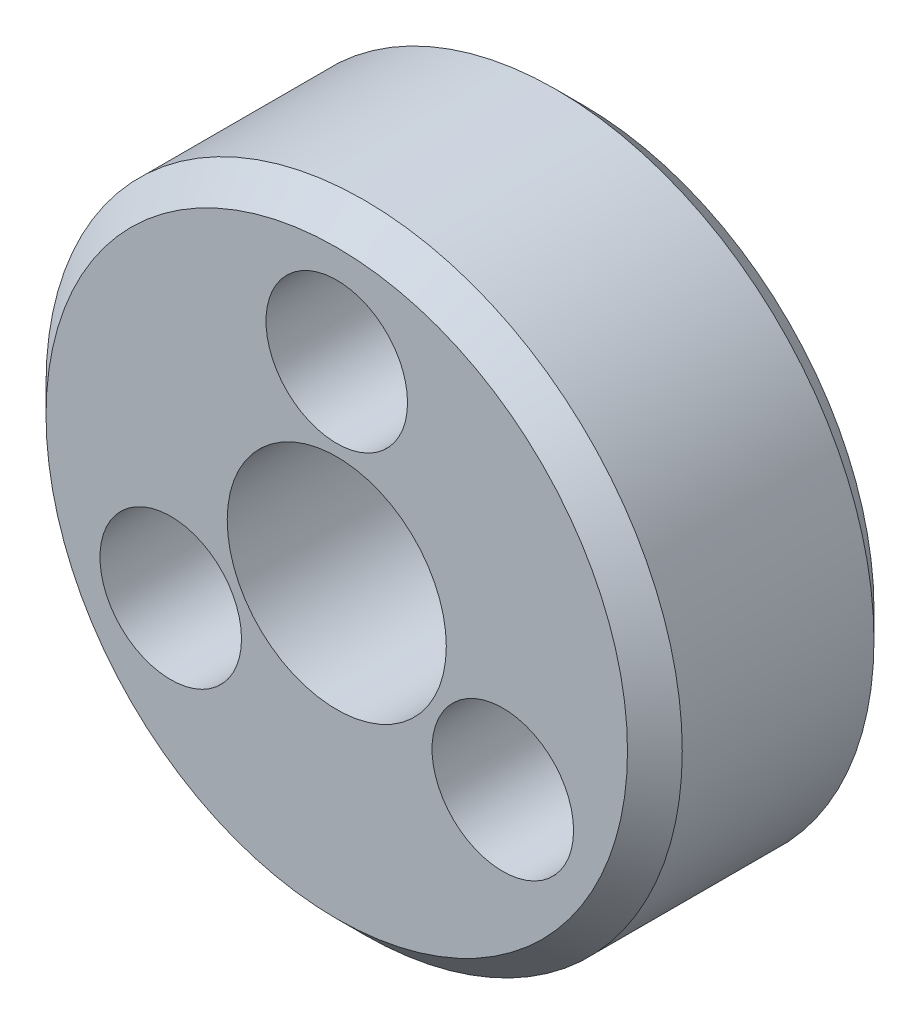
from build123d import *

# Parameters (mm, degrees)
SKETCH1_R         = 18.4404
EXTRUDE1_DEPTH    = 7.14375
HOLE1_D           = 12.7
CIRPATTERN1_COUNT = 3
CHAMFER1_SIZE     = 1.5875


with BuildPart() as part:
    # Sketch1 → Extrude1 (new, symmetric)
    with BuildSketch(Plane.XY):
        Circle(SKETCH1_R)
    extrude(amount=EXTRUDE1_DEPTH, both=True)

    # Hole1 (through all)
    with Locations(Plane.XY.offset(7.14375)):
        with Locations((0, 0)):
            Hole(HOLE1_D / 2)

    # Sketch6 → Hole2 (revolve, cut)
    with BuildSketch(Plane(origin=(0, 11.1125, 7.14375), x_dir=(0, -1, 0), z_dir=(1, 0, 0))):
        Polygon((0, 0), (0, 15.429324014), (1.89865, 14.2885), (1.89865, 6.35), (4.1021, 6.35), (4.1021, 0), align=None)
    hole2 = revolve(axis=Axis((0, 11.1125, 18.454625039), (0, 0, -1)), mode=Mode.SUBTRACT)

    # CirPattern1: Hole2 ×3 about axis
    cirpattern1_axis = Axis((0, 0, 0), (0, 0, 1))
    for i in range(1, CIRPATTERN1_COUNT):
        add(hole2.rotate(cirpattern1_axis, i * 360 / CIRPATTERN1_COUNT), mode=Mode.SUBTRACT)

    # Chamfer1
    chamfer1_edges = [part.edges().sort_by_distance(p)[0] for p in [
        (-18.4404, 0, -7.14375),
        (-18.4404, 0, 7.14375),
    ]]
    chamfer(chamfer1_edges, length=CHAMFER1_SIZE)


solid = part.part
